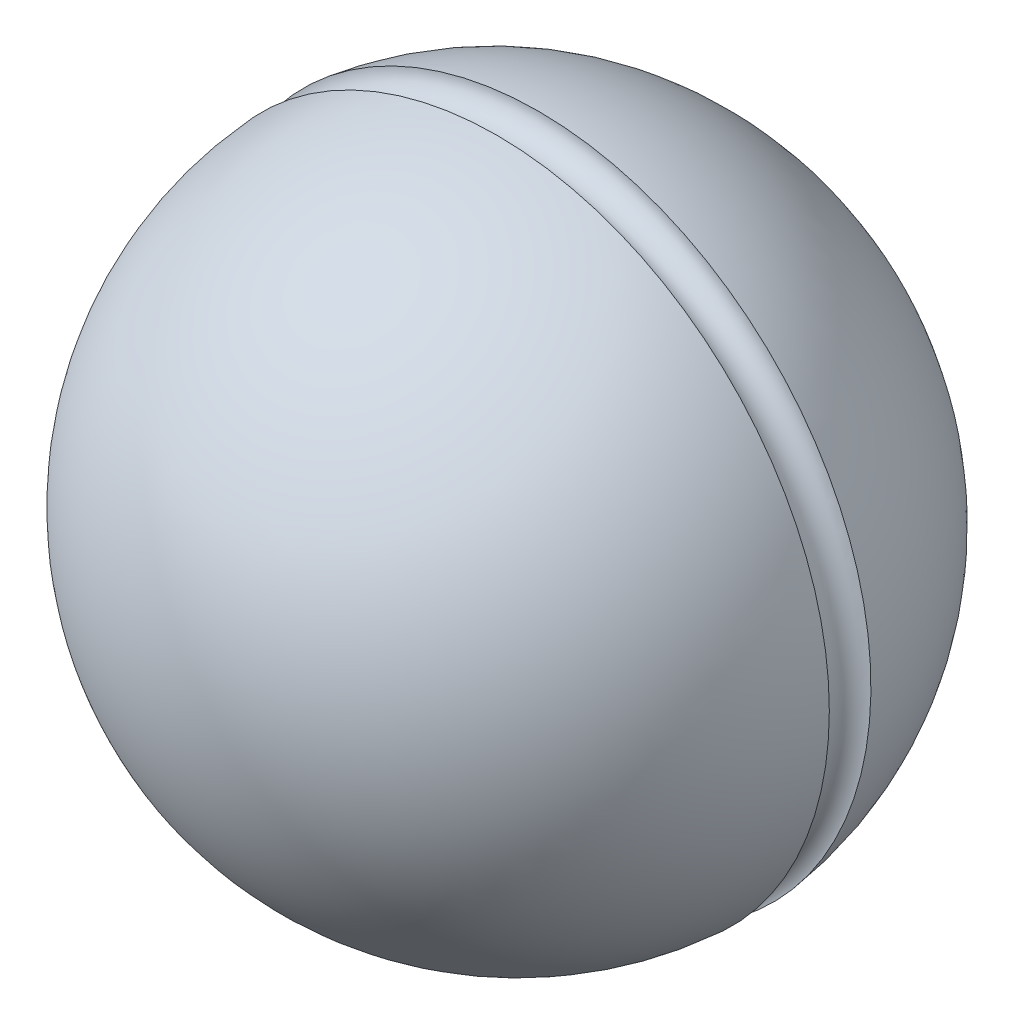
ISO-10303-21;
HEADER;
FILE_DESCRIPTION(('STEP AP214'),'2;1');
FILE_NAME('part.step','',(''),(''),'','','');
FILE_SCHEMA(('AUTOMOTIVE_DESIGN { 1 0 10303 214 1 1 1 1 }'));
ENDSEC;
DATA;
#1=APPLICATION_CONTEXT('core data for automotive mechanical design processes');
#2=APPLICATION_PROTOCOL_DEFINITION('international standard','automotive_design',2000,#1);
#3=PRODUCT_CONTEXT('',#1,'mechanical');
#4=PRODUCT('Part','Part','',(#3));
#5=PRODUCT_RELATED_PRODUCT_CATEGORY('part','',(#4));
#6=PRODUCT_DEFINITION_FORMATION('','',#4);
#7=PRODUCT_DEFINITION_CONTEXT('part definition',#1,'design');
#8=PRODUCT_DEFINITION('design','',#6,#7);
#9=PRODUCT_DEFINITION_SHAPE('','',#8);
#10=(LENGTH_UNIT() NAMED_UNIT(*) SI_UNIT(.MILLI.,.METRE.));
#11=(NAMED_UNIT(*) PLANE_ANGLE_UNIT() SI_UNIT($,.RADIAN.));
#12=(NAMED_UNIT(*) SI_UNIT($,.STERADIAN.) SOLID_ANGLE_UNIT());
#13=UNCERTAINTY_MEASURE_WITH_UNIT(LENGTH_MEASURE(1.E-05),#10,'distance_accuracy_value','');
#14=(GEOMETRIC_REPRESENTATION_CONTEXT(3) GLOBAL_UNCERTAINTY_ASSIGNED_CONTEXT((#13)) GLOBAL_UNIT_ASSIGNED_CONTEXT((#10,
#11,#12)) REPRESENTATION_CONTEXT('',''));
#15=CARTESIAN_POINT('',(0.,0.,0.));
#16=DIRECTION('',(0.,0.,1.));
#17=DIRECTION('',(1.,0.,0.));
#18=AXIS2_PLACEMENT_3D('',#15,#16,#17);
#19=CARTESIAN_POINT('',(5.,0.,18.));
#20=DIRECTION('',(0.,0.,-1.));
#21=DIRECTION('',(0.,1.,0.));
#22=AXIS2_PLACEMENT_3D('',#19,#20,#21);
#23=PLANE('',#22);
#24=CARTESIAN_POINT('',(0.,0.,18.));
#25=DIRECTION('',(0.,0.,-1.));
#26=DIRECTION('',(0.,1.,0.));
#27=AXIS2_PLACEMENT_3D('',#24,#25,#26);
#28=CIRCLE('',#27,5.);
#29=CARTESIAN_POINT('',(0.,5.,18.));
#30=VERTEX_POINT('',#29);
#31=EDGE_CURVE('E8',#30,#30,#28,.T.);
#32=ORIENTED_EDGE('',*,*,#31,.T.);
#33=EDGE_LOOP('',(#32));
#34=FACE_BOUND('',#33,.T.);
#35=ADVANCED_FACE('F12',(#34),#23,.T.);
#36=CARTESIAN_POINT('',(0.,0.,0.));
#37=DIRECTION('',(0.,0.,-1.));
#38=DIRECTION('',(0.,1.,0.));
#39=AXIS2_PLACEMENT_3D('',#36,#37,#38);
#40=CYLINDRICAL_SURFACE('',#39,5.);
#41=CARTESIAN_POINT('',(0.,0.,0.));
#42=DIRECTION('',(0.,0.,-1.));
#43=DIRECTION('',(0.,1.,0.));
#44=AXIS2_PLACEMENT_3D('',#41,#42,#43);
#45=CIRCLE('',#44,5.);
#46=CARTESIAN_POINT('',(0.,5.,0.));
#47=VERTEX_POINT('',#46);
#48=EDGE_CURVE('E18',#47,#47,#45,.T.);
#49=ORIENTED_EDGE('',*,*,#48,.T.);
#50=EDGE_LOOP('',(#49));
#51=FACE_BOUND('',#50,.T.);
#52=ORIENTED_EDGE('',*,*,#31,.F.);
#53=EDGE_LOOP('',(#52));
#54=FACE_BOUND('',#53,.T.);
#55=ADVANCED_FACE('F48',(#51,#54),#40,.F.);
#56=CARTESIAN_POINT('',(7.53565375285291,0.,0.));
#57=DIRECTION('',(0.,0.,-1.));
#58=DIRECTION('',(0.,1.,0.));
#59=AXIS2_PLACEMENT_3D('',#56,#57,#58);
#60=PLANE('',#59);
#61=CARTESIAN_POINT('',(0.,0.,0.));
#62=DIRECTION('',(0.,0.,-1.));
#63=DIRECTION('',(0.,1.,0.));
#64=AXIS2_PLACEMENT_3D('',#61,#62,#63);
#65=CIRCLE('',#64,7.53565375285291);
#66=CARTESIAN_POINT('',(0.,7.53565375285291,0.));
#67=VERTEX_POINT('',#66);
#68=EDGE_CURVE('E22',#67,#67,#65,.T.);
#69=ORIENTED_EDGE('',*,*,#68,.T.);
#70=EDGE_LOOP('',(#69));
#71=FACE_BOUND('',#70,.T.);
#72=ORIENTED_EDGE('',*,*,#48,.F.);
#73=EDGE_LOOP('',(#72));
#74=FACE_BOUND('',#73,.T.);
#75=ADVANCED_FACE('F52',(#71,#74),#60,.T.);
#76=CARTESIAN_POINT('',(0.,0.,18.1249694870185));
#77=DIRECTION('',(0.,0.,-1.));
#78=DIRECTION('',(0.,1.,0.));
#79=AXIS2_PLACEMENT_3D('',#76,#77,#78);
#80=DEGENERATE_TOROIDAL_SURFACE('',#79,0.755556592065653,19.3515951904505,.T.);
#81=CARTESIAN_POINT('',(0.,0.,15.7506105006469));
#82=DIRECTION('',(0.,0.,-1.));
#83=DIRECTION('',(0.,1.,0.));
#84=AXIS2_PLACEMENT_3D('',#81,#82,#83);
#85=CIRCLE('',#84,19.9609375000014);
#86=CARTESIAN_POINT('',(0.,19.9609375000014,15.7506105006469));
#87=VERTEX_POINT('',#86);
#88=EDGE_CURVE('E26',#87,#87,#85,.T.);
#89=ORIENTED_EDGE('',*,*,#88,.T.);
#90=EDGE_LOOP('',(#89));
#91=FACE_BOUND('',#90,.T.);
#92=ORIENTED_EDGE('',*,*,#68,.F.);
#93=EDGE_LOOP('',(#92));
#94=FACE_BOUND('',#93,.T.);
#95=ADVANCED_FACE('F45',(#91,#94),#80,.T.);
#96=CARTESIAN_POINT('',(0.,0.,17.));
#97=DIRECTION('',(0.,0.,-1.));
#98=DIRECTION('',(0.,1.,0.));
#99=AXIS2_PLACEMENT_3D('',#96,#97,#98);
#100=TOROIDAL_SURFACE('',#99,20.,1.25);
#101=CARTESIAN_POINT('',(0.,0.,18.2493894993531));
#102=DIRECTION('',(0.,0.,-1.));
#103=DIRECTION('',(0.,1.,0.));
#104=AXIS2_PLACEMENT_3D('',#101,#102,#103);
#105=CIRCLE('',#104,19.9609375);
#106=CARTESIAN_POINT('',(0.,19.9609375,18.2493894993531));
#107=VERTEX_POINT('',#106);
#108=EDGE_CURVE('E31',#107,#107,#105,.T.);
#109=ORIENTED_EDGE('',*,*,#108,.T.);
#110=EDGE_LOOP('',(#109));
#111=FACE_BOUND('',#110,.T.);
#112=ORIENTED_EDGE('',*,*,#88,.F.);
#113=EDGE_LOOP('',(#112));
#114=FACE_BOUND('',#113,.T.);
#115=ADVANCED_FACE('F35',(#111,#114),#100,.F.);
#116=CARTESIAN_POINT('',(0.,0.,17.));
#117=DIRECTION('',(0.,0.,-1.));
#118=DIRECTION('',(1.,0.,0.));
#119=AXIS2_PLACEMENT_3D('',#116,#117,#118);
#120=SPHERICAL_SURFACE('',#119,20.);
#121=ORIENTED_EDGE('',*,*,#108,.F.);
#122=EDGE_LOOP('',(#121));
#123=FACE_BOUND('',#122,.T.);
#124=ADVANCED_FACE('F38',(#123),#120,.T.);
#125=CLOSED_SHELL('',(#35,#55,#75,#95,#115,#124));
#126=MANIFOLD_SOLID_BREP('B1',#125);
#127=ADVANCED_BREP_SHAPE_REPRESENTATION('',(#18,#126),#14);
#128=SHAPE_DEFINITION_REPRESENTATION(#9,#127);
ENDSEC;
END-ISO-10303-21;
